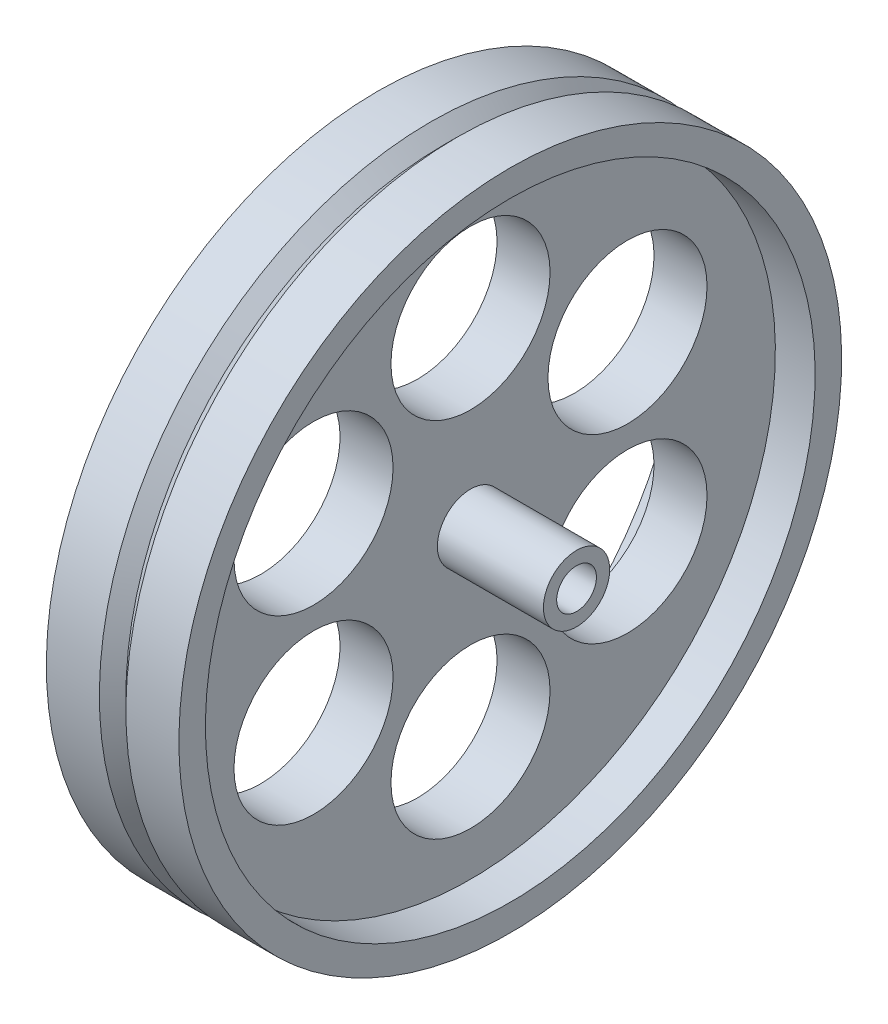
from build123d import *

# Parameters (mm, degrees)
SKETCH3_R          = 12
CUT_EXTRUDE1_DEPTH = 20


with BuildPart() as part:
    # Sketch2 → Revolve1 (revolve)
    with BuildSketch(Plane.XY):
        Polygon((0, 0), (0, 2), (6, 2), (6, 43), (0, 43), (0, 47), (8, 47), (10, 45), (12, 47), (20, 47), (20, 43), (14, 43), (14, 2), (20, 2), (30, 2), (30, 0), align=None)
    revolve(axis=Axis((30, -3, 0), (-1, 0, 0)))

    # Sketch3 → Cut-Extrude1 (cut)
    with BuildSketch(Plane.ZY):
        with Locations(Location((23.687295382, 10.675866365, 0), (0, 0, 270))):
            Circle(SKETCH3_R)
        with Locations(Location((0, 24.35173273, 0), (0, 0, 270))):
            Circle(SKETCH3_R)
        with Locations(Location((23.687295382, -16.675866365, 0), (0, 0, 270))):
            Circle(SKETCH3_R)
        with Locations(Location((0, -30.35173273, 0), (0, 0, 270))):
            Circle(SKETCH3_R)
        with Locations(Location((-23.687295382, -16.675866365, 0), (0, 0, 270))):
            Circle(SKETCH3_R)
        with Locations(Location((-23.687295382, 10.675866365, 0), (0, 0, 270))):
            Circle(SKETCH3_R)
    extrude(amount=-CUT_EXTRUDE1_DEPTH, mode=Mode.SUBTRACT)


solid = part.part
